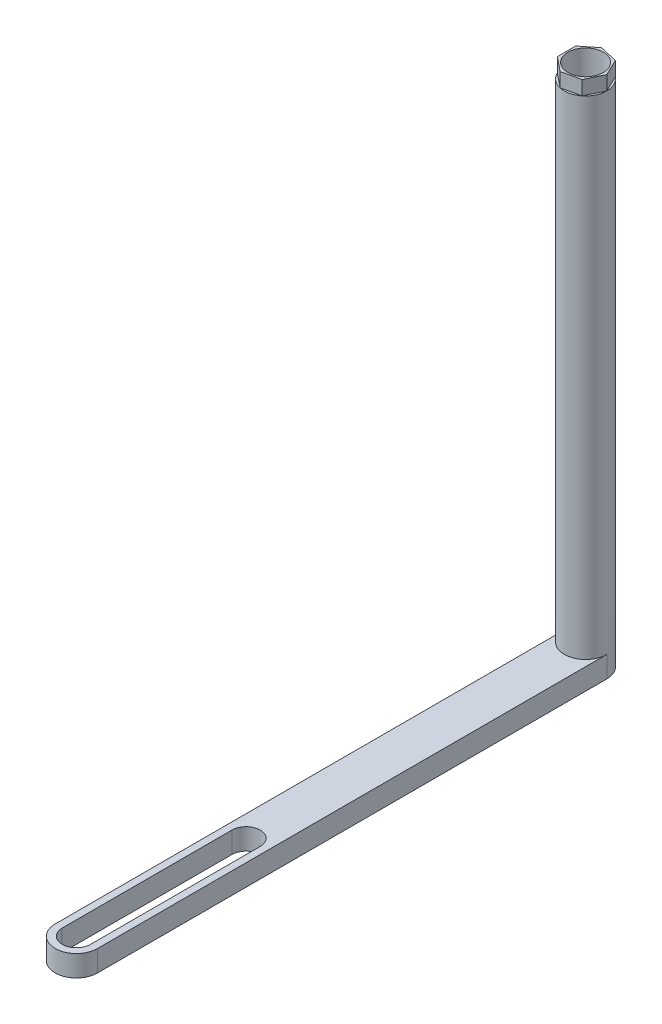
ISO-10303-21;
HEADER;
FILE_DESCRIPTION(('STEP AP214'),'2;1');
FILE_NAME('part.step','',(''),(''),'','','');
FILE_SCHEMA(('AUTOMOTIVE_DESIGN { 1 0 10303 214 1 1 1 1 }'));
ENDSEC;
DATA;
#1=APPLICATION_CONTEXT('core data for automotive mechanical design processes');
#2=APPLICATION_PROTOCOL_DEFINITION('international standard','automotive_design',2000,#1);
#3=PRODUCT_CONTEXT('',#1,'mechanical');
#4=PRODUCT('Part','Part','',(#3));
#5=PRODUCT_RELATED_PRODUCT_CATEGORY('part','',(#4));
#6=PRODUCT_DEFINITION_FORMATION('','',#4);
#7=PRODUCT_DEFINITION_CONTEXT('part definition',#1,'design');
#8=PRODUCT_DEFINITION('design','',#6,#7);
#9=PRODUCT_DEFINITION_SHAPE('','',#8);
#10=(LENGTH_UNIT() NAMED_UNIT(*) SI_UNIT(.MILLI.,.METRE.));
#11=(NAMED_UNIT(*) PLANE_ANGLE_UNIT() SI_UNIT($,.RADIAN.));
#12=(NAMED_UNIT(*) SI_UNIT($,.STERADIAN.) SOLID_ANGLE_UNIT());
#13=UNCERTAINTY_MEASURE_WITH_UNIT(LENGTH_MEASURE(1.E-05),#10,'distance_accuracy_value','');
#14=(GEOMETRIC_REPRESENTATION_CONTEXT(3) GLOBAL_UNCERTAINTY_ASSIGNED_CONTEXT((#13)) GLOBAL_UNIT_ASSIGNED_CONTEXT((#10,
#11,#12)) REPRESENTATION_CONTEXT('',''));
#15=CARTESIAN_POINT('',(0.,0.,0.));
#16=DIRECTION('',(0.,0.,1.));
#17=DIRECTION('',(1.,0.,0.));
#18=AXIS2_PLACEMENT_3D('',#15,#16,#17);
#19=CARTESIAN_POINT('',(0.,37.,0.));
#20=DIRECTION('',(0.,-1.,0.));
#21=DIRECTION('',(0.,0.,-1.));
#22=AXIS2_PLACEMENT_3D('',#19,#20,#21);
#23=CYLINDRICAL_SURFACE('',#22,1.5);
#24=CARTESIAN_POINT('',(0.,1.5,0.));
#25=DIRECTION('',(0.,-1.,0.));
#26=DIRECTION('',(0.,0.,-1.));
#27=AXIS2_PLACEMENT_3D('',#24,#25,#26);
#28=CIRCLE('',#27,1.5);
#29=CARTESIAN_POINT('',(1.5,1.5,0.));
#30=VERTEX_POINT('',#29);
#31=CARTESIAN_POINT('',(-1.5,1.5,0.));
#32=VERTEX_POINT('',#31);
#33=EDGE_CURVE('E73',#30,#32,#28,.T.);
#34=ORIENTED_EDGE('',*,*,#33,.F.);
#35=DIRECTION('',(0.,-1.,0.));
#36=VECTOR('',#35,1.);
#37=CARTESIAN_POINT('',(1.5,1.5,0.));
#38=LINE('',#37,#36);
#39=CARTESIAN_POINT('',(1.5,0.,0.));
#40=VERTEX_POINT('',#39);
#41=EDGE_CURVE('E248',#30,#40,#38,.T.);
#42=ORIENTED_EDGE('',*,*,#41,.T.);
#43=CARTESIAN_POINT('',(0.,0.,0.));
#44=DIRECTION('',(0.,1.,0.));
#45=DIRECTION('',(0.,0.,1.));
#46=AXIS2_PLACEMENT_3D('',#43,#44,#45);
#47=CIRCLE('',#46,1.5);
#48=CARTESIAN_POINT('',(-1.5,0.,0.));
#49=VERTEX_POINT('',#48);
#50=EDGE_CURVE('E12',#40,#49,#47,.T.);
#51=ORIENTED_EDGE('',*,*,#50,.T.);
#52=DIRECTION('',(0.,-1.,0.));
#53=VECTOR('',#52,1.);
#54=CARTESIAN_POINT('',(-1.5,1.5,0.));
#55=LINE('',#54,#53);
#56=EDGE_CURVE('E77',#32,#49,#55,.T.);
#57=ORIENTED_EDGE('',*,*,#56,.F.);
#58=EDGE_LOOP('',(#34,#42,#51,#57));
#59=FACE_BOUND('',#58,.T.);
#60=CARTESIAN_POINT('',(0.,36.,0.));
#61=DIRECTION('',(0.,1.,0.));
#62=DIRECTION('',(0.,0.,1.));
#63=AXIS2_PLACEMENT_3D('',#60,#61,#62);
#64=CIRCLE('',#63,1.5);
#65=CARTESIAN_POINT('',(-1.35145330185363,36.,0.650825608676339));
#66=VERTEX_POINT('',#65);
#67=CARTESIAN_POINT('',(-0.33378140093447,36.,1.46239186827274));
#68=VERTEX_POINT('',#67);
#69=EDGE_CURVE('E180',#66,#68,#64,.T.);
#70=ORIENTED_EDGE('',*,*,#69,.F.);
#71=CARTESIAN_POINT('',(0.,36.,0.));
#72=DIRECTION('',(0.,1.,0.));
#73=DIRECTION('',(0.,0.,1.));
#74=AXIS2_PLACEMENT_3D('',#71,#72,#73);
#75=CIRCLE('',#74,1.5);
#76=CARTESIAN_POINT('',(-1.35145330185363,36.,-0.650825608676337));
#77=VERTEX_POINT('',#76);
#78=EDGE_CURVE('E188',#77,#66,#75,.T.);
#79=ORIENTED_EDGE('',*,*,#78,.F.);
#80=CARTESIAN_POINT('',(0.,36.,0.));
#81=DIRECTION('',(0.,1.,0.));
#82=DIRECTION('',(0.,0.,1.));
#83=AXIS2_PLACEMENT_3D('',#80,#81,#82);
#84=CIRCLE('',#83,1.5);
#85=CARTESIAN_POINT('',(-0.333781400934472,36.,-1.46239186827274));
#86=VERTEX_POINT('',#85);
#87=EDGE_CURVE('E296',#86,#77,#84,.T.);
#88=ORIENTED_EDGE('',*,*,#87,.F.);
#89=CARTESIAN_POINT('',(0.,36.,0.));
#90=DIRECTION('',(0.,1.,0.));
#91=DIRECTION('',(0.,0.,1.));
#92=AXIS2_PLACEMENT_3D('',#89,#90,#91);
#93=CIRCLE('',#92,1.5);
#94=CARTESIAN_POINT('',(0.935234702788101,36.,-1.17274722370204));
#95=VERTEX_POINT('',#94);
#96=EDGE_CURVE('E299',#95,#86,#93,.T.);
#97=ORIENTED_EDGE('',*,*,#96,.F.);
#98=CARTESIAN_POINT('',(0.,36.,0.));
#99=DIRECTION('',(0.,1.,0.));
#100=DIRECTION('',(0.,0.,1.));
#101=AXIS2_PLACEMENT_3D('',#98,#99,#100);
#102=CIRCLE('',#101,1.5);
#103=CARTESIAN_POINT('',(1.5,36.,0.));
#104=VERTEX_POINT('',#103);
#105=EDGE_CURVE('E309',#104,#95,#102,.T.);
#106=ORIENTED_EDGE('',*,*,#105,.F.);
#107=CARTESIAN_POINT('',(0.,36.,0.));
#108=DIRECTION('',(0.,1.,0.));
#109=DIRECTION('',(0.,0.,1.));
#110=AXIS2_PLACEMENT_3D('',#107,#108,#109);
#111=CIRCLE('',#110,1.5);
#112=CARTESIAN_POINT('',(0.935234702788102,36.,1.17274722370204));
#113=VERTEX_POINT('',#112);
#114=EDGE_CURVE('E328',#113,#104,#111,.T.);
#115=ORIENTED_EDGE('',*,*,#114,.F.);
#116=CARTESIAN_POINT('',(0.,36.,0.));
#117=DIRECTION('',(0.,1.,0.));
#118=DIRECTION('',(0.,0.,1.));
#119=AXIS2_PLACEMENT_3D('',#116,#117,#118);
#120=CIRCLE('',#119,1.5);
#121=EDGE_CURVE('E190',#68,#113,#120,.T.);
#122=ORIENTED_EDGE('',*,*,#121,.F.);
#123=EDGE_LOOP('',(#70,#79,#88,#97,#106,#115,#122));
#124=FACE_BOUND('',#123,.T.);
#125=ADVANCED_FACE('F59',(#59,#124),#23,.T.);
#126=CARTESIAN_POINT('',(0.,37.,0.));
#127=DIRECTION('',(0.,1.,0.));
#128=DIRECTION('',(0.,0.,1.));
#129=AXIS2_PLACEMENT_3D('',#126,#127,#128);
#130=PLANE('',#129);
#131=CARTESIAN_POINT('',(0.,37.,0.));
#132=DIRECTION('',(0.,1.,0.));
#133=DIRECTION('',(0.,0.,1.));
#134=AXIS2_PLACEMENT_3D('',#131,#132,#133);
#135=CIRCLE('',#134,1.25);
#136=CARTESIAN_POINT('',(0.,37.,1.25));
#137=VERTEX_POINT('',#136);
#138=EDGE_CURVE('E66',#137,#137,#135,.T.);
#139=ORIENTED_EDGE('',*,*,#138,.F.);
#140=EDGE_LOOP('',(#139));
#141=FACE_BOUND('',#140,.T.);
#142=DIRECTION('',(0.,0.,1.));
#143=VECTOR('',#142,1.);
#144=CARTESIAN_POINT('',(-1.35145330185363,37.,0.));
#145=LINE('',#144,#143);
#146=CARTESIAN_POINT('',(-1.35145330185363,37.,-0.650825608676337));
#147=VERTEX_POINT('',#146);
#148=CARTESIAN_POINT('',(-1.35145330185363,37.,0.650825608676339));
#149=VERTEX_POINT('',#148);
#150=EDGE_CURVE('E197',#147,#149,#145,.T.);
#151=ORIENTED_EDGE('',*,*,#150,.T.);
#152=DIRECTION('',(0.78183148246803,0.,0.623489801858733));
#153=VECTOR('',#152,1.);
#154=CARTESIAN_POINT('',(-0.842617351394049,37.,1.05660873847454));
#155=LINE('',#154,#153);
#156=CARTESIAN_POINT('',(-0.33378140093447,37.,1.46239186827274));
#157=VERTEX_POINT('',#156);
#158=EDGE_CURVE('E169',#149,#157,#155,.T.);
#159=ORIENTED_EDGE('',*,*,#158,.T.);
#160=DIRECTION('',(0.974927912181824,0.,-0.222520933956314));
#161=VECTOR('',#160,1.);
#162=CARTESIAN_POINT('',(0.300726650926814,37.,1.31756954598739));
#163=LINE('',#162,#161);
#164=CARTESIAN_POINT('',(0.935234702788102,37.,1.17274722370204));
#165=VERTEX_POINT('',#164);
#166=EDGE_CURVE('E181',#157,#165,#163,.T.);
#167=ORIENTED_EDGE('',*,*,#166,.T.);
#168=DIRECTION('',(0.433883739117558,0.,-0.900968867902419));
#169=VECTOR('',#168,1.);
#170=CARTESIAN_POINT('',(1.21761735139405,37.,0.586373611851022));
#171=LINE('',#170,#169);
#172=CARTESIAN_POINT('',(1.5,37.,0.));
#173=VERTEX_POINT('',#172);
#174=EDGE_CURVE('E331',#165,#173,#171,.T.);
#175=ORIENTED_EDGE('',*,*,#174,.T.);
#176=DIRECTION('',(-0.433883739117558,0.,-0.900968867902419));
#177=VECTOR('',#176,1.);
#178=CARTESIAN_POINT('',(1.21761735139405,37.,-0.586373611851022));
#179=LINE('',#178,#177);
#180=CARTESIAN_POINT('',(0.935234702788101,37.,-1.17274722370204));
#181=VERTEX_POINT('',#180);
#182=EDGE_CURVE('E322',#173,#181,#179,.T.);
#183=ORIENTED_EDGE('',*,*,#182,.T.);
#184=DIRECTION('',(-0.974927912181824,0.,-0.222520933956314));
#185=VECTOR('',#184,1.);
#186=CARTESIAN_POINT('',(0.300726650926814,37.,-1.31756954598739));
#187=LINE('',#186,#185);
#188=CARTESIAN_POINT('',(-0.333781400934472,37.,-1.46239186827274));
#189=VERTEX_POINT('',#188);
#190=EDGE_CURVE('E290',#181,#189,#187,.T.);
#191=ORIENTED_EDGE('',*,*,#190,.T.);
#192=DIRECTION('',(-0.78183148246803,0.,0.623489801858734));
#193=VECTOR('',#192,1.);
#194=CARTESIAN_POINT('',(-0.842617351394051,37.,-1.05660873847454));
#195=LINE('',#194,#193);
#196=EDGE_CURVE('E287',#189,#147,#195,.T.);
#197=ORIENTED_EDGE('',*,*,#196,.T.);
#198=EDGE_LOOP('',(#151,#159,#167,#175,#183,#191,#197));
#199=FACE_BOUND('',#198,.T.);
#200=ADVANCED_FACE('F278',(#141,#199),#130,.T.);
#201=CARTESIAN_POINT('',(0.,0.,0.));
#202=DIRECTION('',(0.,1.,0.));
#203=DIRECTION('',(0.,0.,1.));
#204=AXIS2_PLACEMENT_3D('',#201,#202,#203);
#205=PLANE('',#204);
#206=ORIENTED_EDGE('',*,*,#50,.F.);
#207=DIRECTION('',(0.,0.,1.));
#208=VECTOR('',#207,1.);
#209=CARTESIAN_POINT('',(1.5,0.,0.));
#210=LINE('',#209,#208);
#211=CARTESIAN_POINT('',(1.5,0.,36.));
#212=VERTEX_POINT('',#211);
#213=EDGE_CURVE('E231',#40,#212,#210,.T.);
#214=ORIENTED_EDGE('',*,*,#213,.T.);
#215=CARTESIAN_POINT('',(0.,0.,36.));
#216=DIRECTION('',(0.,-1.,0.));
#217=DIRECTION('',(0.,0.,-1.));
#218=AXIS2_PLACEMENT_3D('',#215,#216,#217);
#219=CIRCLE('',#218,1.5);
#220=CARTESIAN_POINT('',(-1.5,0.,36.));
#221=VERTEX_POINT('',#220);
#222=EDGE_CURVE('E251',#212,#221,#219,.T.);
#223=ORIENTED_EDGE('',*,*,#222,.T.);
#224=DIRECTION('',(0.,0.,-1.));
#225=VECTOR('',#224,1.);
#226=CARTESIAN_POINT('',(-1.5,0.,0.));
#227=LINE('',#226,#225);
#228=EDGE_CURVE('E242',#221,#49,#227,.T.);
#229=ORIENTED_EDGE('',*,*,#228,.T.);
#230=EDGE_LOOP('',(#206,#214,#223,#229));
#231=FACE_BOUND('',#230,.T.);
#232=CARTESIAN_POINT('',(0.,0.,0.));
#233=DIRECTION('',(0.,1.,0.));
#234=DIRECTION('',(0.,0.,1.));
#235=AXIS2_PLACEMENT_3D('',#232,#233,#234);
#236=CIRCLE('',#235,1.25);
#237=CARTESIAN_POINT('',(0.,0.,1.25));
#238=VERTEX_POINT('',#237);
#239=EDGE_CURVE('E263',#238,#238,#236,.T.);
#240=ORIENTED_EDGE('',*,*,#239,.T.);
#241=EDGE_LOOP('',(#240));
#242=FACE_BOUND('',#241,.T.);
#243=CARTESIAN_POINT('',(0.,0.,36.));
#244=DIRECTION('',(0.,-1.,0.));
#245=DIRECTION('',(0.,0.,-1.));
#246=AXIS2_PLACEMENT_3D('',#243,#244,#245);
#247=CIRCLE('',#246,1.);
#248=CARTESIAN_POINT('',(1.,0.,36.));
#249=VERTEX_POINT('',#248);
#250=CARTESIAN_POINT('',(-1.,0.,36.));
#251=VERTEX_POINT('',#250);
#252=EDGE_CURVE('E174',#249,#251,#247,.T.);
#253=ORIENTED_EDGE('',*,*,#252,.F.);
#254=DIRECTION('',(0.,0.,1.));
#255=VECTOR('',#254,1.);
#256=CARTESIAN_POINT('',(1.,0.,36.));
#257=LINE('',#256,#255);
#258=CARTESIAN_POINT('',(1.,0.,24.));
#259=VERTEX_POINT('',#258);
#260=EDGE_CURVE('E210',#259,#249,#257,.T.);
#261=ORIENTED_EDGE('',*,*,#260,.F.);
#262=CARTESIAN_POINT('',(0.,0.,24.));
#263=DIRECTION('',(0.,-1.,0.));
#264=DIRECTION('',(0.,0.,-1.));
#265=AXIS2_PLACEMENT_3D('',#262,#263,#264);
#266=CIRCLE('',#265,1.);
#267=CARTESIAN_POINT('',(-0.999999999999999,0.,24.));
#268=VERTEX_POINT('',#267);
#269=EDGE_CURVE('E224',#268,#259,#266,.T.);
#270=ORIENTED_EDGE('',*,*,#269,.F.);
#271=DIRECTION('',(0.,0.,-1.));
#272=VECTOR('',#271,1.);
#273=CARTESIAN_POINT('',(-1.,0.,36.));
#274=LINE('',#273,#272);
#275=EDGE_CURVE('E221',#251,#268,#274,.T.);
#276=ORIENTED_EDGE('',*,*,#275,.F.);
#277=EDGE_LOOP('',(#253,#261,#270,#276));
#278=FACE_BOUND('',#277,.T.);
#279=ADVANCED_FACE('F268',(#231,#242,#278),#205,.F.);
#280=CARTESIAN_POINT('',(0.,37.,0.));
#281=DIRECTION('',(0.,-1.,0.));
#282=DIRECTION('',(0.,0.,-1.));
#283=AXIS2_PLACEMENT_3D('',#280,#281,#282);
#284=CYLINDRICAL_SURFACE('',#283,1.25);
#285=ORIENTED_EDGE('',*,*,#239,.F.);
#286=EDGE_LOOP('',(#285));
#287=FACE_BOUND('',#286,.T.);
#288=ORIENTED_EDGE('',*,*,#138,.T.);
#289=EDGE_LOOP('',(#288));
#290=FACE_BOUND('',#289,.T.);
#291=ADVANCED_FACE('F271',(#287,#290),#284,.F.);
#292=CARTESIAN_POINT('',(0.,1.5,0.));
#293=DIRECTION('',(0.,-1.,0.));
#294=DIRECTION('',(0.,0.,-1.));
#295=AXIS2_PLACEMENT_3D('',#292,#293,#294);
#296=PLANE('',#295);
#297=DIRECTION('',(0.,0.,1.));
#298=VECTOR('',#297,1.);
#299=CARTESIAN_POINT('',(1.,1.5,36.));
#300=LINE('',#299,#298);
#301=CARTESIAN_POINT('',(1.,1.5,24.));
#302=VERTEX_POINT('',#301);
#303=CARTESIAN_POINT('',(1.,1.5,36.));
#304=VERTEX_POINT('',#303);
#305=EDGE_CURVE('E216',#302,#304,#300,.T.);
#306=ORIENTED_EDGE('',*,*,#305,.T.);
#307=CARTESIAN_POINT('',(0.,1.5,36.));
#308=DIRECTION('',(0.,-1.,0.));
#309=DIRECTION('',(0.,0.,-1.));
#310=AXIS2_PLACEMENT_3D('',#307,#308,#309);
#311=CIRCLE('',#310,1.);
#312=CARTESIAN_POINT('',(-1.,1.5,36.));
#313=VERTEX_POINT('',#312);
#314=EDGE_CURVE('E206',#304,#313,#311,.T.);
#315=ORIENTED_EDGE('',*,*,#314,.T.);
#316=DIRECTION('',(0.,0.,-1.));
#317=VECTOR('',#316,1.);
#318=CARTESIAN_POINT('',(-1.,1.5,36.));
#319=LINE('',#318,#317);
#320=CARTESIAN_POINT('',(-0.999999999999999,1.5,24.));
#321=VERTEX_POINT('',#320);
#322=EDGE_CURVE('E209',#313,#321,#319,.T.);
#323=ORIENTED_EDGE('',*,*,#322,.T.);
#324=CARTESIAN_POINT('',(0.,1.5,24.));
#325=DIRECTION('',(0.,-1.,0.));
#326=DIRECTION('',(0.,0.,-1.));
#327=AXIS2_PLACEMENT_3D('',#324,#325,#326);
#328=CIRCLE('',#327,1.);
#329=EDGE_CURVE('E213',#321,#302,#328,.T.);
#330=ORIENTED_EDGE('',*,*,#329,.T.);
#331=EDGE_LOOP('',(#306,#315,#323,#330));
#332=FACE_BOUND('',#331,.T.);
#333=DIRECTION('',(0.,0.,1.));
#334=VECTOR('',#333,1.);
#335=CARTESIAN_POINT('',(1.5,1.5,0.));
#336=LINE('',#335,#334);
#337=CARTESIAN_POINT('',(1.5,1.5,36.));
#338=VERTEX_POINT('',#337);
#339=EDGE_CURVE('E238',#30,#338,#336,.T.);
#340=ORIENTED_EDGE('',*,*,#339,.F.);
#341=ORIENTED_EDGE('',*,*,#33,.T.);
#342=DIRECTION('',(0.,0.,-1.));
#343=VECTOR('',#342,1.);
#344=CARTESIAN_POINT('',(-1.5,1.5,0.));
#345=LINE('',#344,#343);
#346=CARTESIAN_POINT('',(-1.5,1.5,36.));
#347=VERTEX_POINT('',#346);
#348=EDGE_CURVE('E245',#347,#32,#345,.T.);
#349=ORIENTED_EDGE('',*,*,#348,.F.);
#350=CARTESIAN_POINT('',(0.,1.5,36.));
#351=DIRECTION('',(0.,-1.,0.));
#352=DIRECTION('',(0.,0.,-1.));
#353=AXIS2_PLACEMENT_3D('',#350,#351,#352);
#354=CIRCLE('',#353,1.5);
#355=EDGE_CURVE('E241',#338,#347,#354,.T.);
#356=ORIENTED_EDGE('',*,*,#355,.F.);
#357=EDGE_LOOP('',(#340,#341,#349,#356));
#358=FACE_BOUND('',#357,.T.);
#359=ADVANCED_FACE('F274',(#332,#358),#296,.F.);
#360=CARTESIAN_POINT('',(-1.5,1.5,0.));
#361=DIRECTION('',(-1.,0.,0.));
#362=DIRECTION('',(0.,0.,1.));
#363=AXIS2_PLACEMENT_3D('',#360,#361,#362);
#364=PLANE('',#363);
#365=ORIENTED_EDGE('',*,*,#228,.F.);
#366=DIRECTION('',(0.,-1.,0.));
#367=VECTOR('',#366,1.);
#368=CARTESIAN_POINT('',(-1.5,1.5,36.));
#369=LINE('',#368,#367);
#370=EDGE_CURVE('E257',#347,#221,#369,.T.);
#371=ORIENTED_EDGE('',*,*,#370,.F.);
#372=ORIENTED_EDGE('',*,*,#348,.T.);
#373=ORIENTED_EDGE('',*,*,#56,.T.);
#374=EDGE_LOOP('',(#365,#371,#372,#373));
#375=FACE_BOUND('',#374,.T.);
#376=ADVANCED_FACE('F383',(#375),#364,.T.);
#377=CARTESIAN_POINT('',(0.,1.5,36.));
#378=DIRECTION('',(0.,-1.,0.));
#379=DIRECTION('',(0.,0.,-1.));
#380=AXIS2_PLACEMENT_3D('',#377,#378,#379);
#381=CYLINDRICAL_SURFACE('',#380,1.5);
#382=ORIENTED_EDGE('',*,*,#222,.F.);
#383=DIRECTION('',(0.,-1.,0.));
#384=VECTOR('',#383,1.);
#385=CARTESIAN_POINT('',(1.5,1.5,36.));
#386=LINE('',#385,#384);
#387=EDGE_CURVE('E259',#338,#212,#386,.T.);
#388=ORIENTED_EDGE('',*,*,#387,.F.);
#389=ORIENTED_EDGE('',*,*,#355,.T.);
#390=ORIENTED_EDGE('',*,*,#370,.T.);
#391=EDGE_LOOP('',(#382,#388,#389,#390));
#392=FACE_BOUND('',#391,.T.);
#393=ADVANCED_FACE('F391',(#392),#381,.T.);
#394=CARTESIAN_POINT('',(1.5,1.5,0.));
#395=DIRECTION('',(1.,0.,0.));
#396=DIRECTION('',(0.,0.,-1.));
#397=AXIS2_PLACEMENT_3D('',#394,#395,#396);
#398=PLANE('',#397);
#399=ORIENTED_EDGE('',*,*,#213,.F.);
#400=ORIENTED_EDGE('',*,*,#41,.F.);
#401=ORIENTED_EDGE('',*,*,#339,.T.);
#402=ORIENTED_EDGE('',*,*,#387,.T.);
#403=EDGE_LOOP('',(#399,#400,#401,#402));
#404=FACE_BOUND('',#403,.T.);
#405=ADVANCED_FACE('F399',(#404),#398,.T.);
#406=CARTESIAN_POINT('',(0.,1.5,36.));
#407=DIRECTION('',(0.,-1.,0.));
#408=DIRECTION('',(0.,0.,-1.));
#409=AXIS2_PLACEMENT_3D('',#406,#407,#408);
#410=CYLINDRICAL_SURFACE('',#409,1.);
#411=ORIENTED_EDGE('',*,*,#252,.T.);
#412=DIRECTION('',(0.,-1.,0.));
#413=VECTOR('',#412,1.);
#414=CARTESIAN_POINT('',(-1.,1.5,36.));
#415=LINE('',#414,#413);
#416=EDGE_CURVE('E219',#313,#251,#415,.T.);
#417=ORIENTED_EDGE('',*,*,#416,.F.);
#418=ORIENTED_EDGE('',*,*,#314,.F.);
#419=DIRECTION('',(0.,-1.,0.));
#420=VECTOR('',#419,1.);
#421=CARTESIAN_POINT('',(1.,1.5,36.));
#422=LINE('',#421,#420);
#423=EDGE_CURVE('E229',#304,#249,#422,.T.);
#424=ORIENTED_EDGE('',*,*,#423,.T.);
#425=EDGE_LOOP('',(#411,#417,#418,#424));
#426=FACE_BOUND('',#425,.T.);
#427=ADVANCED_FACE('F407',(#426),#410,.F.);
#428=CARTESIAN_POINT('',(1.,1.5,36.));
#429=DIRECTION('',(1.,0.,0.));
#430=DIRECTION('',(0.,0.,-1.));
#431=AXIS2_PLACEMENT_3D('',#428,#429,#430);
#432=PLANE('',#431);
#433=ORIENTED_EDGE('',*,*,#260,.T.);
#434=ORIENTED_EDGE('',*,*,#423,.F.);
#435=ORIENTED_EDGE('',*,*,#305,.F.);
#436=DIRECTION('',(0.,-1.,0.));
#437=VECTOR('',#436,1.);
#438=CARTESIAN_POINT('',(1.,1.5,24.));
#439=LINE('',#438,#437);
#440=EDGE_CURVE('E232',#302,#259,#439,.T.);
#441=ORIENTED_EDGE('',*,*,#440,.T.);
#442=EDGE_LOOP('',(#433,#434,#435,#441));
#443=FACE_BOUND('',#442,.T.);
#444=ADVANCED_FACE('F415',(#443),#432,.F.);
#445=CARTESIAN_POINT('',(0.,1.5,24.));
#446=DIRECTION('',(0.,-1.,0.));
#447=DIRECTION('',(0.,0.,-1.));
#448=AXIS2_PLACEMENT_3D('',#445,#446,#447);
#449=CYLINDRICAL_SURFACE('',#448,1.);
#450=ORIENTED_EDGE('',*,*,#269,.T.);
#451=ORIENTED_EDGE('',*,*,#440,.F.);
#452=ORIENTED_EDGE('',*,*,#329,.F.);
#453=DIRECTION('',(0.,-1.,0.));
#454=VECTOR('',#453,1.);
#455=CARTESIAN_POINT('',(-0.999999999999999,1.5,24.));
#456=LINE('',#455,#454);
#457=EDGE_CURVE('E234',#321,#268,#456,.T.);
#458=ORIENTED_EDGE('',*,*,#457,.T.);
#459=EDGE_LOOP('',(#450,#451,#452,#458));
#460=FACE_BOUND('',#459,.T.);
#461=ADVANCED_FACE('F423',(#460),#449,.F.);
#462=CARTESIAN_POINT('',(-1.,1.5,36.));
#463=DIRECTION('',(-1.,0.,0.));
#464=DIRECTION('',(0.,0.,1.));
#465=AXIS2_PLACEMENT_3D('',#462,#463,#464);
#466=PLANE('',#465);
#467=ORIENTED_EDGE('',*,*,#275,.T.);
#468=ORIENTED_EDGE('',*,*,#457,.F.);
#469=ORIENTED_EDGE('',*,*,#322,.F.);
#470=ORIENTED_EDGE('',*,*,#416,.T.);
#471=EDGE_LOOP('',(#467,#468,#469,#470));
#472=FACE_BOUND('',#471,.T.);
#473=ADVANCED_FACE('F431',(#472),#466,.F.);
#474=CARTESIAN_POINT('',(-1.35145330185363,36.,0.));
#475=DIRECTION('',(-1.,0.,0.));
#476=DIRECTION('',(0.,0.,1.));
#477=AXIS2_PLACEMENT_3D('',#474,#475,#476);
#478=PLANE('',#477);
#479=ORIENTED_EDGE('',*,*,#150,.F.);
#480=DIRECTION('',(0.,1.,0.));
#481=VECTOR('',#480,1.);
#482=CARTESIAN_POINT('',(-1.35145330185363,36.,-0.650825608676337));
#483=LINE('',#482,#481);
#484=EDGE_CURVE('E175',#77,#147,#483,.T.);
#485=ORIENTED_EDGE('',*,*,#484,.F.);
#486=DIRECTION('',(0.,0.,1.));
#487=VECTOR('',#486,1.);
#488=CARTESIAN_POINT('',(-1.35145330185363,36.,0.));
#489=LINE('',#488,#487);
#490=EDGE_CURVE('E194',#77,#66,#489,.T.);
#491=ORIENTED_EDGE('',*,*,#490,.T.);
#492=DIRECTION('',(0.,1.,0.));
#493=VECTOR('',#492,1.);
#494=CARTESIAN_POINT('',(-1.35145330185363,36.,0.650825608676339));
#495=LINE('',#494,#493);
#496=EDGE_CURVE('E163',#66,#149,#495,.T.);
#497=ORIENTED_EDGE('',*,*,#496,.T.);
#498=EDGE_LOOP('',(#479,#485,#491,#497));
#499=FACE_BOUND('',#498,.T.);
#500=ADVANCED_FACE('F195',(#499),#478,.T.);
#501=CARTESIAN_POINT('',(0.,36.,0.));
#502=DIRECTION('',(0.,1.,0.));
#503=DIRECTION('',(0.,0.,1.));
#504=AXIS2_PLACEMENT_3D('',#501,#502,#503);
#505=PLANE('',#504);
#506=ORIENTED_EDGE('',*,*,#490,.F.);
#507=ORIENTED_EDGE('',*,*,#78,.T.);
#508=EDGE_LOOP('',(#506,#507));
#509=FACE_BOUND('',#508,.T.);
#510=ADVANCED_FACE('F199',(#509),#505,.T.);
#511=CARTESIAN_POINT('',(-0.842617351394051,36.,-1.05660873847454));
#512=DIRECTION('',(-0.623489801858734,0.,-0.78183148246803));
#513=DIRECTION('',(-0.78183148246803,0.,0.623489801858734));
#514=AXIS2_PLACEMENT_3D('',#511,#512,#513);
#515=PLANE('',#514);
#516=ORIENTED_EDGE('',*,*,#196,.F.);
#517=DIRECTION('',(0.,1.,0.));
#518=VECTOR('',#517,1.);
#519=CARTESIAN_POINT('',(-0.333781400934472,36.,-1.46239186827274));
#520=LINE('',#519,#518);
#521=EDGE_CURVE('E293',#86,#189,#520,.T.);
#522=ORIENTED_EDGE('',*,*,#521,.F.);
#523=DIRECTION('',(-0.78183148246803,0.,0.623489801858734));
#524=VECTOR('',#523,1.);
#525=CARTESIAN_POINT('',(-0.842617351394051,36.,-1.05660873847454));
#526=LINE('',#525,#524);
#527=EDGE_CURVE('E204',#86,#77,#526,.T.);
#528=ORIENTED_EDGE('',*,*,#527,.T.);
#529=ORIENTED_EDGE('',*,*,#484,.T.);
#530=EDGE_LOOP('',(#516,#522,#528,#529));
#531=FACE_BOUND('',#530,.T.);
#532=ADVANCED_FACE('F304',(#531),#515,.T.);
#533=CARTESIAN_POINT('',(0.,36.,0.));
#534=DIRECTION('',(0.,1.,0.));
#535=DIRECTION('',(0.,0.,1.));
#536=AXIS2_PLACEMENT_3D('',#533,#534,#535);
#537=PLANE('',#536);
#538=ORIENTED_EDGE('',*,*,#527,.F.);
#539=ORIENTED_EDGE('',*,*,#87,.T.);
#540=EDGE_LOOP('',(#538,#539));
#541=FACE_BOUND('',#540,.T.);
#542=ADVANCED_FACE('F306',(#541),#537,.T.);
#543=CARTESIAN_POINT('',(0.300726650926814,36.,-1.31756954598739));
#544=DIRECTION('',(0.222520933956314,0.,-0.974927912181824));
#545=DIRECTION('',(-0.974927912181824,0.,-0.222520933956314));
#546=AXIS2_PLACEMENT_3D('',#543,#544,#545);
#547=PLANE('',#546);
#548=ORIENTED_EDGE('',*,*,#190,.F.);
#549=DIRECTION('',(0.,1.,0.));
#550=VECTOR('',#549,1.);
#551=CARTESIAN_POINT('',(0.935234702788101,36.,-1.17274722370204));
#552=LINE('',#551,#550);
#553=EDGE_CURVE('E312',#95,#181,#552,.T.);
#554=ORIENTED_EDGE('',*,*,#553,.F.);
#555=DIRECTION('',(-0.974927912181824,0.,-0.222520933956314));
#556=VECTOR('',#555,1.);
#557=CARTESIAN_POINT('',(0.300726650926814,36.,-1.31756954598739));
#558=LINE('',#557,#556);
#559=EDGE_CURVE('E294',#95,#86,#558,.T.);
#560=ORIENTED_EDGE('',*,*,#559,.T.);
#561=ORIENTED_EDGE('',*,*,#521,.T.);
#562=EDGE_LOOP('',(#548,#554,#560,#561));
#563=FACE_BOUND('',#562,.T.);
#564=ADVANCED_FACE('F462',(#563),#547,.T.);
#565=CARTESIAN_POINT('',(0.,36.,0.));
#566=DIRECTION('',(0.,1.,0.));
#567=DIRECTION('',(0.,0.,1.));
#568=AXIS2_PLACEMENT_3D('',#565,#566,#567);
#569=PLANE('',#568);
#570=ORIENTED_EDGE('',*,*,#559,.F.);
#571=ORIENTED_EDGE('',*,*,#96,.T.);
#572=EDGE_LOOP('',(#570,#571));
#573=FACE_BOUND('',#572,.T.);
#574=ADVANCED_FACE('F469',(#573),#569,.T.);
#575=CARTESIAN_POINT('',(1.21761735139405,36.,-0.586373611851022));
#576=DIRECTION('',(0.900968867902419,0.,-0.433883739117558));
#577=DIRECTION('',(-0.433883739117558,0.,-0.900968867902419));
#578=AXIS2_PLACEMENT_3D('',#575,#576,#577);
#579=PLANE('',#578);
#580=ORIENTED_EDGE('',*,*,#182,.F.);
#581=DIRECTION('',(0.,1.,0.));
#582=VECTOR('',#581,1.);
#583=CARTESIAN_POINT('',(1.5,36.,0.));
#584=LINE('',#583,#582);
#585=EDGE_CURVE('E321',#104,#173,#584,.T.);
#586=ORIENTED_EDGE('',*,*,#585,.F.);
#587=DIRECTION('',(-0.433883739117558,0.,-0.900968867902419));
#588=VECTOR('',#587,1.);
#589=CARTESIAN_POINT('',(1.21761735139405,36.,-0.586373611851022));
#590=LINE('',#589,#588);
#591=EDGE_CURVE('E316',#104,#95,#590,.T.);
#592=ORIENTED_EDGE('',*,*,#591,.T.);
#593=ORIENTED_EDGE('',*,*,#553,.T.);
#594=EDGE_LOOP('',(#580,#586,#592,#593));
#595=FACE_BOUND('',#594,.T.);
#596=ADVANCED_FACE('F477',(#595),#579,.T.);
#597=CARTESIAN_POINT('',(0.,36.,0.));
#598=DIRECTION('',(0.,1.,0.));
#599=DIRECTION('',(0.,0.,1.));
#600=AXIS2_PLACEMENT_3D('',#597,#598,#599);
#601=PLANE('',#600);
#602=ORIENTED_EDGE('',*,*,#591,.F.);
#603=ORIENTED_EDGE('',*,*,#105,.T.);
#604=EDGE_LOOP('',(#602,#603));
#605=FACE_BOUND('',#604,.T.);
#606=ADVANCED_FACE('F484',(#605),#601,.T.);
#607=CARTESIAN_POINT('',(1.21761735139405,36.,0.586373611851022));
#608=DIRECTION('',(0.900968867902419,0.,0.433883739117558));
#609=DIRECTION('',(0.433883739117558,0.,-0.900968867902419));
#610=AXIS2_PLACEMENT_3D('',#607,#608,#609);
#611=PLANE('',#610);
#612=ORIENTED_EDGE('',*,*,#174,.F.);
#613=DIRECTION('',(0.,1.,0.));
#614=VECTOR('',#613,1.);
#615=CARTESIAN_POINT('',(0.935234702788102,36.,1.17274722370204));
#616=LINE('',#615,#614);
#617=EDGE_CURVE('E330',#113,#165,#616,.T.);
#618=ORIENTED_EDGE('',*,*,#617,.F.);
#619=DIRECTION('',(0.433883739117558,0.,-0.900968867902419));
#620=VECTOR('',#619,1.);
#621=CARTESIAN_POINT('',(1.21761735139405,36.,0.586373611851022));
#622=LINE('',#621,#620);
#623=EDGE_CURVE('E324',#113,#104,#622,.T.);
#624=ORIENTED_EDGE('',*,*,#623,.T.);
#625=ORIENTED_EDGE('',*,*,#585,.T.);
#626=EDGE_LOOP('',(#612,#618,#624,#625));
#627=FACE_BOUND('',#626,.T.);
#628=ADVANCED_FACE('F492',(#627),#611,.T.);
#629=CARTESIAN_POINT('',(0.,36.,0.));
#630=DIRECTION('',(0.,1.,0.));
#631=DIRECTION('',(0.,0.,1.));
#632=AXIS2_PLACEMENT_3D('',#629,#630,#631);
#633=PLANE('',#632);
#634=ORIENTED_EDGE('',*,*,#623,.F.);
#635=ORIENTED_EDGE('',*,*,#114,.T.);
#636=EDGE_LOOP('',(#634,#635));
#637=FACE_BOUND('',#636,.T.);
#638=ADVANCED_FACE('F355',(#637),#633,.T.);
#639=CARTESIAN_POINT('',(0.300726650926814,36.,1.31756954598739));
#640=DIRECTION('',(0.222520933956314,0.,0.974927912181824));
#641=DIRECTION('',(0.974927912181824,0.,-0.222520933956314));
#642=AXIS2_PLACEMENT_3D('',#639,#640,#641);
#643=PLANE('',#642);
#644=ORIENTED_EDGE('',*,*,#166,.F.);
#645=DIRECTION('',(0.,1.,0.));
#646=VECTOR('',#645,1.);
#647=CARTESIAN_POINT('',(-0.33378140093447,36.,1.46239186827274));
#648=LINE('',#647,#646);
#649=EDGE_CURVE('E339',#68,#157,#648,.T.);
#650=ORIENTED_EDGE('',*,*,#649,.F.);
#651=DIRECTION('',(0.974927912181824,0.,-0.222520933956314));
#652=VECTOR('',#651,1.);
#653=CARTESIAN_POINT('',(0.300726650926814,36.,1.31756954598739));
#654=LINE('',#653,#652);
#655=EDGE_CURVE('E334',#68,#113,#654,.T.);
#656=ORIENTED_EDGE('',*,*,#655,.T.);
#657=ORIENTED_EDGE('',*,*,#617,.T.);
#658=EDGE_LOOP('',(#644,#650,#656,#657));
#659=FACE_BOUND('',#658,.T.);
#660=ADVANCED_FACE('F344',(#659),#643,.T.);
#661=CARTESIAN_POINT('',(0.,36.,0.));
#662=DIRECTION('',(0.,1.,0.));
#663=DIRECTION('',(0.,0.,1.));
#664=AXIS2_PLACEMENT_3D('',#661,#662,#663);
#665=PLANE('',#664);
#666=ORIENTED_EDGE('',*,*,#655,.F.);
#667=ORIENTED_EDGE('',*,*,#121,.T.);
#668=EDGE_LOOP('',(#666,#667));
#669=FACE_BOUND('',#668,.T.);
#670=ADVANCED_FACE('F347',(#669),#665,.T.);
#671=CARTESIAN_POINT('',(-0.842617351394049,36.,1.05660873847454));
#672=DIRECTION('',(-0.623489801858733,0.,0.78183148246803));
#673=DIRECTION('',(0.78183148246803,0.,0.623489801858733));
#674=AXIS2_PLACEMENT_3D('',#671,#672,#673);
#675=PLANE('',#674);
#676=ORIENTED_EDGE('',*,*,#158,.F.);
#677=ORIENTED_EDGE('',*,*,#496,.F.);
#678=DIRECTION('',(0.78183148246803,0.,0.623489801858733));
#679=VECTOR('',#678,1.);
#680=CARTESIAN_POINT('',(-0.842617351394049,36.,1.05660873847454));
#681=LINE('',#680,#679);
#682=EDGE_CURVE('E166',#66,#68,#681,.T.);
#683=ORIENTED_EDGE('',*,*,#682,.T.);
#684=ORIENTED_EDGE('',*,*,#649,.T.);
#685=EDGE_LOOP('',(#676,#677,#683,#684));
#686=FACE_BOUND('',#685,.T.);
#687=ADVANCED_FACE('F165',(#686),#675,.T.);
#688=CARTESIAN_POINT('',(0.,36.,0.));
#689=DIRECTION('',(0.,1.,0.));
#690=DIRECTION('',(0.,0.,1.));
#691=AXIS2_PLACEMENT_3D('',#688,#689,#690);
#692=PLANE('',#691);
#693=ORIENTED_EDGE('',*,*,#682,.F.);
#694=ORIENTED_EDGE('',*,*,#69,.T.);
#695=EDGE_LOOP('',(#693,#694));
#696=FACE_BOUND('',#695,.T.);
#697=ADVANCED_FACE('F179',(#696),#692,.T.);
#698=CLOSED_SHELL('',(#125,#200,#279,#291,#359,#376,#393,#405,#427,#444,#461,#473,#500,#510,
#532,#542,#564,#574,#596,#606,#628,#638,#660,#670,#687,#697));
#699=MANIFOLD_SOLID_BREP('B2',#698);
#700=ADVANCED_BREP_SHAPE_REPRESENTATION('',(#18,#699),#14);
#701=SHAPE_DEFINITION_REPRESENTATION(#9,#700);
ENDSEC;
END-ISO-10303-21;
